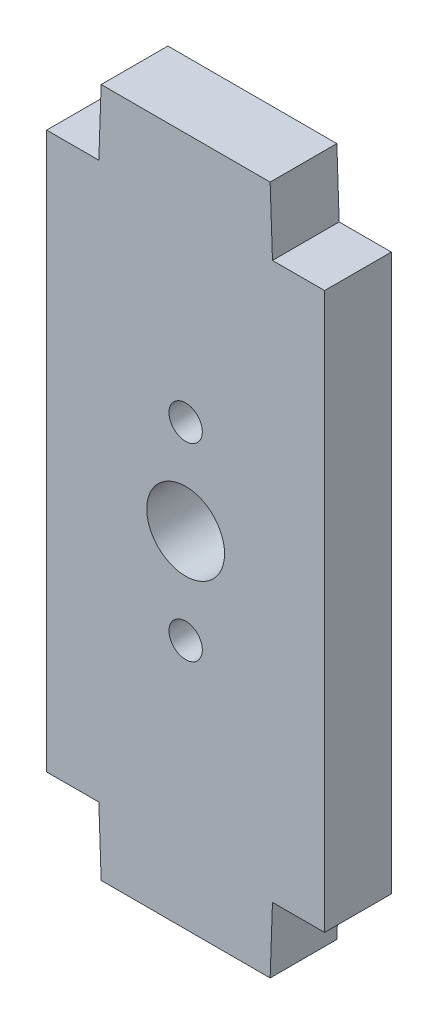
ISO-10303-21;
HEADER;
FILE_DESCRIPTION(('STEP AP214'),'2;1');
FILE_NAME('part.step','',(''),(''),'','','');
FILE_SCHEMA(('AUTOMOTIVE_DESIGN { 1 0 10303 214 1 1 1 1 }'));
ENDSEC;
DATA;
#1=APPLICATION_CONTEXT('core data for automotive mechanical design processes');
#2=APPLICATION_PROTOCOL_DEFINITION('international standard','automotive_design',2000,#1);
#3=PRODUCT_CONTEXT('',#1,'mechanical');
#4=PRODUCT('Part','Part','',(#3));
#5=PRODUCT_RELATED_PRODUCT_CATEGORY('part','',(#4));
#6=PRODUCT_DEFINITION_FORMATION('','',#4);
#7=PRODUCT_DEFINITION_CONTEXT('part definition',#1,'design');
#8=PRODUCT_DEFINITION('design','',#6,#7);
#9=PRODUCT_DEFINITION_SHAPE('','',#8);
#10=(LENGTH_UNIT() NAMED_UNIT(*) SI_UNIT(.MILLI.,.METRE.));
#11=(NAMED_UNIT(*) PLANE_ANGLE_UNIT() SI_UNIT($,.RADIAN.));
#12=(NAMED_UNIT(*) SI_UNIT($,.STERADIAN.) SOLID_ANGLE_UNIT());
#13=UNCERTAINTY_MEASURE_WITH_UNIT(LENGTH_MEASURE(1.E-05),#10,'distance_accuracy_value','');
#14=(GEOMETRIC_REPRESENTATION_CONTEXT(3) GLOBAL_UNCERTAINTY_ASSIGNED_CONTEXT((#13)) GLOBAL_UNIT_ASSIGNED_CONTEXT((#10,
#11,#12)) REPRESENTATION_CONTEXT('',''));
#15=CARTESIAN_POINT('',(0.,0.,0.));
#16=DIRECTION('',(0.,0.,1.));
#17=DIRECTION('',(1.,0.,0.));
#18=AXIS2_PLACEMENT_3D('',#15,#16,#17);
#19=CARTESIAN_POINT('',(-12.5,-25.,6.));
#20=DIRECTION('',(0.,1.,0.));
#21=DIRECTION('',(0.,0.,1.));
#22=AXIS2_PLACEMENT_3D('',#19,#20,#21);
#23=PLANE('',#22);
#24=DIRECTION('',(0.,0.,1.));
#25=VECTOR('',#24,1.);
#26=CARTESIAN_POINT('',(7.8095246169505,-25.,-16.7318468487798));
#27=LINE('',#26,#25);
#28=CARTESIAN_POINT('',(7.8095246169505,-25.,0.));
#29=VERTEX_POINT('',#28);
#30=CARTESIAN_POINT('',(7.8095246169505,-25.,6.));
#31=VERTEX_POINT('',#30);
#32=EDGE_CURVE('E135',#29,#31,#27,.T.);
#33=ORIENTED_EDGE('',*,*,#32,.F.);
#34=DIRECTION('',(1.,0.,0.));
#35=VECTOR('',#34,1.);
#36=CARTESIAN_POINT('',(-12.5,-25.,0.));
#37=LINE('',#36,#35);
#38=CARTESIAN_POINT('',(12.5,-25.,0.));
#39=VERTEX_POINT('',#38);
#40=EDGE_CURVE('E145',#29,#39,#37,.T.);
#41=ORIENTED_EDGE('',*,*,#40,.T.);
#42=DIRECTION('',(0.,0.,-1.));
#43=VECTOR('',#42,1.);
#44=CARTESIAN_POINT('',(12.5,-25.,6.));
#45=LINE('',#44,#43);
#46=CARTESIAN_POINT('',(12.5,-25.,6.));
#47=VERTEX_POINT('',#46);
#48=EDGE_CURVE('E49',#47,#39,#45,.T.);
#49=ORIENTED_EDGE('',*,*,#48,.F.);
#50=DIRECTION('',(1.,0.,0.));
#51=VECTOR('',#50,1.);
#52=CARTESIAN_POINT('',(-12.5,-25.,6.));
#53=LINE('',#52,#51);
#54=EDGE_CURVE('E147',#31,#47,#53,.T.);
#55=ORIENTED_EDGE('',*,*,#54,.F.);
#56=EDGE_LOOP('',(#33,#41,#49,#55));
#57=FACE_BOUND('',#56,.T.);
#58=ADVANCED_FACE('F41',(#57),#23,.F.);
#59=CARTESIAN_POINT('',(-12.5,25.,6.));
#60=DIRECTION('',(0.,-1.,0.));
#61=DIRECTION('',(0.,0.,-1.));
#62=AXIS2_PLACEMENT_3D('',#59,#60,#61);
#63=PLANE('',#62);
#64=DIRECTION('',(0.,0.,1.));
#65=VECTOR('',#64,1.);
#66=CARTESIAN_POINT('',(-7.8095246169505,25.,-16.7318468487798));
#67=LINE('',#66,#65);
#68=CARTESIAN_POINT('',(-7.8095246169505,25.,0.));
#69=VERTEX_POINT('',#68);
#70=CARTESIAN_POINT('',(-7.8095246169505,25.,6.));
#71=VERTEX_POINT('',#70);
#72=EDGE_CURVE('E197',#69,#71,#67,.T.);
#73=ORIENTED_EDGE('',*,*,#72,.F.);
#74=DIRECTION('',(-1.,0.,0.));
#75=VECTOR('',#74,1.);
#76=CARTESIAN_POINT('',(-12.5,25.,0.));
#77=LINE('',#76,#75);
#78=CARTESIAN_POINT('',(-12.5,25.,0.));
#79=VERTEX_POINT('',#78);
#80=EDGE_CURVE('E165',#69,#79,#77,.T.);
#81=ORIENTED_EDGE('',*,*,#80,.T.);
#82=DIRECTION('',(0.,0.,-1.));
#83=VECTOR('',#82,1.);
#84=CARTESIAN_POINT('',(-12.5,25.,6.));
#85=LINE('',#84,#83);
#86=CARTESIAN_POINT('',(-12.5,25.,6.));
#87=VERTEX_POINT('',#86);
#88=EDGE_CURVE('E170',#87,#79,#85,.T.);
#89=ORIENTED_EDGE('',*,*,#88,.F.);
#90=DIRECTION('',(-1.,0.,0.));
#91=VECTOR('',#90,1.);
#92=CARTESIAN_POINT('',(-12.5,25.,6.));
#93=LINE('',#92,#91);
#94=EDGE_CURVE('E184',#71,#87,#93,.T.);
#95=ORIENTED_EDGE('',*,*,#94,.F.);
#96=EDGE_LOOP('',(#73,#81,#89,#95));
#97=FACE_BOUND('',#96,.T.);
#98=ADVANCED_FACE('F264',(#97),#63,.F.);
#99=CARTESIAN_POINT('',(-12.5,-25.,6.));
#100=DIRECTION('',(1.,0.,0.));
#101=DIRECTION('',(0.,0.,-1.));
#102=AXIS2_PLACEMENT_3D('',#99,#100,#101);
#103=PLANE('',#102);
#104=DIRECTION('',(0.,-1.,0.));
#105=VECTOR('',#104,1.);
#106=CARTESIAN_POINT('',(-12.5,-25.,0.));
#107=LINE('',#106,#105);
#108=CARTESIAN_POINT('',(-12.5,-25.,0.));
#109=VERTEX_POINT('',#108);
#110=EDGE_CURVE('E156',#79,#109,#107,.T.);
#111=ORIENTED_EDGE('',*,*,#110,.T.);
#112=DIRECTION('',(0.,0.,-1.));
#113=VECTOR('',#112,1.);
#114=CARTESIAN_POINT('',(-12.5,-25.,6.));
#115=LINE('',#114,#113);
#116=CARTESIAN_POINT('',(-12.5,-25.,6.));
#117=VERTEX_POINT('',#116);
#118=EDGE_CURVE('E11',#117,#109,#115,.T.);
#119=ORIENTED_EDGE('',*,*,#118,.F.);
#120=DIRECTION('',(0.,-1.,0.));
#121=VECTOR('',#120,1.);
#122=CARTESIAN_POINT('',(-12.5,-25.,6.));
#123=LINE('',#122,#121);
#124=EDGE_CURVE('E169',#87,#117,#123,.T.);
#125=ORIENTED_EDGE('',*,*,#124,.F.);
#126=ORIENTED_EDGE('',*,*,#88,.T.);
#127=EDGE_LOOP('',(#111,#119,#125,#126));
#128=FACE_BOUND('',#127,.T.);
#129=ADVANCED_FACE('F43',(#128),#103,.F.);
#130=CARTESIAN_POINT('',(-7.8095246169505,-25.,0.));
#131=VERTEX_POINT('',#130);
#132=EDGE_CURVE('E155',#109,#131,#37,.T.);
#133=ORIENTED_EDGE('',*,*,#132,.T.);
#134=DIRECTION('',(0.,0.,1.));
#135=VECTOR('',#134,1.);
#136=CARTESIAN_POINT('',(-7.8095246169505,-25.,-16.7318468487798));
#137=LINE('',#136,#135);
#138=CARTESIAN_POINT('',(-7.8095246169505,-25.,6.));
#139=VERTEX_POINT('',#138);
#140=EDGE_CURVE('E148',#131,#139,#137,.T.);
#141=ORIENTED_EDGE('',*,*,#140,.T.);
#142=EDGE_CURVE('E185',#117,#139,#53,.T.);
#143=ORIENTED_EDGE('',*,*,#142,.F.);
#144=ORIENTED_EDGE('',*,*,#118,.T.);
#145=EDGE_LOOP('',(#133,#141,#143,#144));
#146=FACE_BOUND('',#145,.T.);
#147=ADVANCED_FACE('F268',(#146),#23,.F.);
#148=CARTESIAN_POINT('',(12.5,-25.,6.));
#149=DIRECTION('',(-1.,0.,0.));
#150=DIRECTION('',(0.,0.,1.));
#151=AXIS2_PLACEMENT_3D('',#148,#149,#150);
#152=PLANE('',#151);
#153=DIRECTION('',(0.,1.,0.));
#154=VECTOR('',#153,1.);
#155=CARTESIAN_POINT('',(12.5,-25.,0.));
#156=LINE('',#155,#154);
#157=CARTESIAN_POINT('',(12.5,25.,0.));
#158=VERTEX_POINT('',#157);
#159=EDGE_CURVE('E154',#39,#158,#156,.T.);
#160=ORIENTED_EDGE('',*,*,#159,.T.);
#161=DIRECTION('',(0.,0.,-1.));
#162=VECTOR('',#161,1.);
#163=CARTESIAN_POINT('',(12.5,25.,6.));
#164=LINE('',#163,#162);
#165=CARTESIAN_POINT('',(12.5,25.,6.));
#166=VERTEX_POINT('',#165);
#167=EDGE_CURVE('E173',#166,#158,#164,.T.);
#168=ORIENTED_EDGE('',*,*,#167,.F.);
#169=DIRECTION('',(0.,1.,0.));
#170=VECTOR('',#169,1.);
#171=CARTESIAN_POINT('',(12.5,-25.,6.));
#172=LINE('',#171,#170);
#173=EDGE_CURVE('E180',#47,#166,#172,.T.);
#174=ORIENTED_EDGE('',*,*,#173,.F.);
#175=ORIENTED_EDGE('',*,*,#48,.T.);
#176=EDGE_LOOP('',(#160,#168,#174,#175));
#177=FACE_BOUND('',#176,.T.);
#178=ADVANCED_FACE('F178',(#177),#152,.F.);
#179=CARTESIAN_POINT('',(7.8095246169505,25.,0.));
#180=VERTEX_POINT('',#179);
#181=EDGE_CURVE('E166',#158,#180,#77,.T.);
#182=ORIENTED_EDGE('',*,*,#181,.T.);
#183=DIRECTION('',(0.,0.,1.));
#184=VECTOR('',#183,1.);
#185=CARTESIAN_POINT('',(7.8095246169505,25.,-16.7318468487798));
#186=LINE('',#185,#184);
#187=CARTESIAN_POINT('',(7.8095246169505,25.,6.));
#188=VERTEX_POINT('',#187);
#189=EDGE_CURVE('E195',#180,#188,#186,.T.);
#190=ORIENTED_EDGE('',*,*,#189,.T.);
#191=EDGE_CURVE('E174',#166,#188,#93,.T.);
#192=ORIENTED_EDGE('',*,*,#191,.F.);
#193=ORIENTED_EDGE('',*,*,#167,.T.);
#194=EDGE_LOOP('',(#182,#190,#192,#193));
#195=FACE_BOUND('',#194,.T.);
#196=ADVANCED_FACE('F194',(#195),#63,.F.);
#197=CARTESIAN_POINT('',(0.,0.,6.));
#198=DIRECTION('',(0.,0.,-1.));
#199=DIRECTION('',(-1.,0.,0.));
#200=AXIS2_PLACEMENT_3D('',#197,#198,#199);
#201=PLANE('',#200);
#202=CARTESIAN_POINT('',(0.,8.5,6.));
#203=DIRECTION('',(0.,0.,1.));
#204=DIRECTION('',(1.,0.,0.));
#205=AXIS2_PLACEMENT_3D('',#202,#203,#204);
#206=CIRCLE('',#205,1.5);
#207=CARTESIAN_POINT('',(1.5,8.5,6.));
#208=VERTEX_POINT('',#207);
#209=EDGE_CURVE('E226',#208,#208,#206,.T.);
#210=ORIENTED_EDGE('',*,*,#209,.F.);
#211=EDGE_LOOP('',(#210));
#212=FACE_BOUND('',#211,.T.);
#213=CARTESIAN_POINT('',(0.,-8.5,6.));
#214=DIRECTION('',(0.,0.,1.));
#215=DIRECTION('',(1.,0.,0.));
#216=AXIS2_PLACEMENT_3D('',#213,#214,#215);
#217=CIRCLE('',#216,1.5);
#218=CARTESIAN_POINT('',(1.5,-8.5,6.));
#219=VERTEX_POINT('',#218);
#220=EDGE_CURVE('E219',#219,#219,#217,.T.);
#221=ORIENTED_EDGE('',*,*,#220,.F.);
#222=EDGE_LOOP('',(#221));
#223=FACE_BOUND('',#222,.T.);
#224=CARTESIAN_POINT('',(0.,0.,6.));
#225=DIRECTION('',(0.,0.,1.));
#226=DIRECTION('',(1.,0.,0.));
#227=AXIS2_PLACEMENT_3D('',#224,#225,#226);
#228=CIRCLE('',#227,3.5);
#229=CARTESIAN_POINT('',(3.5,0.,6.));
#230=VERTEX_POINT('',#229);
#231=EDGE_CURVE('E222',#230,#230,#228,.T.);
#232=ORIENTED_EDGE('',*,*,#231,.F.);
#233=EDGE_LOOP('',(#232));
#234=FACE_BOUND('',#233,.T.);
#235=ORIENTED_EDGE('',*,*,#124,.T.);
#236=ORIENTED_EDGE('',*,*,#142,.T.);
#237=DIRECTION('',(0.0348994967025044,-0.999390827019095,0.));
#238=VECTOR('',#237,1.);
#239=CARTESIAN_POINT('',(-7.8095246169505,-25.,6.));
#240=LINE('',#239,#238);
#241=CARTESIAN_POINT('',(-7.6,-31.,6.));
#242=VERTEX_POINT('',#241);
#243=EDGE_CURVE('E56',#139,#242,#240,.T.);
#244=ORIENTED_EDGE('',*,*,#243,.T.);
#245=DIRECTION('',(1.,0.,0.));
#246=VECTOR('',#245,1.);
#247=CARTESIAN_POINT('',(-7.6,-31.,6.));
#248=LINE('',#247,#246);
#249=CARTESIAN_POINT('',(7.59999999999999,-31.,6.));
#250=VERTEX_POINT('',#249);
#251=EDGE_CURVE('E214',#242,#250,#248,.T.);
#252=ORIENTED_EDGE('',*,*,#251,.T.);
#253=DIRECTION('',(0.0348994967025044,0.999390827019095,0.));
#254=VECTOR('',#253,1.);
#255=CARTESIAN_POINT('',(7.8095246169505,-25.,6.));
#256=LINE('',#255,#254);
#257=EDGE_CURVE('E238',#250,#31,#256,.T.);
#258=ORIENTED_EDGE('',*,*,#257,.T.);
#259=ORIENTED_EDGE('',*,*,#54,.T.);
#260=ORIENTED_EDGE('',*,*,#173,.T.);
#261=ORIENTED_EDGE('',*,*,#191,.T.);
#262=DIRECTION('',(-0.0348994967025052,0.999390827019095,0.));
#263=VECTOR('',#262,1.);
#264=CARTESIAN_POINT('',(7.8095246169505,25.,6.));
#265=LINE('',#264,#263);
#266=CARTESIAN_POINT('',(7.59999999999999,31.,6.));
#267=VERTEX_POINT('',#266);
#268=EDGE_CURVE('E64',#188,#267,#265,.T.);
#269=ORIENTED_EDGE('',*,*,#268,.T.);
#270=DIRECTION('',(-1.,0.,0.));
#271=VECTOR('',#270,1.);
#272=CARTESIAN_POINT('',(7.59999999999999,31.,6.));
#273=LINE('',#272,#271);
#274=CARTESIAN_POINT('',(-7.6,31.,6.));
#275=VERTEX_POINT('',#274);
#276=EDGE_CURVE('E212',#267,#275,#273,.T.);
#277=ORIENTED_EDGE('',*,*,#276,.T.);
#278=DIRECTION('',(-0.0348994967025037,-0.999390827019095,0.));
#279=VECTOR('',#278,1.);
#280=CARTESIAN_POINT('',(-7.8095246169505,25.,6.));
#281=LINE('',#280,#279);
#282=EDGE_CURVE('E215',#275,#71,#281,.T.);
#283=ORIENTED_EDGE('',*,*,#282,.T.);
#284=ORIENTED_EDGE('',*,*,#94,.T.);
#285=EDGE_LOOP('',(#235,#236,#244,#252,#258,#259,#260,#261,#269,#277,#283,#284));
#286=FACE_BOUND('',#285,.T.);
#287=ADVANCED_FACE('F191',(#212,#223,#234,#286),#201,.F.);
#288=CARTESIAN_POINT('',(0.,0.,0.));
#289=DIRECTION('',(0.,0.,-1.));
#290=DIRECTION('',(-1.,0.,0.));
#291=AXIS2_PLACEMENT_3D('',#288,#289,#290);
#292=PLANE('',#291);
#293=CARTESIAN_POINT('',(0.,8.5,0.));
#294=DIRECTION('',(0.,0.,1.));
#295=DIRECTION('',(1.,0.,0.));
#296=AXIS2_PLACEMENT_3D('',#293,#294,#295);
#297=CIRCLE('',#296,1.5);
#298=CARTESIAN_POINT('',(1.5,8.5,0.));
#299=VERTEX_POINT('',#298);
#300=EDGE_CURVE('E229',#299,#299,#297,.T.);
#301=ORIENTED_EDGE('',*,*,#300,.T.);
#302=EDGE_LOOP('',(#301));
#303=FACE_BOUND('',#302,.T.);
#304=CARTESIAN_POINT('',(0.,-8.5,0.));
#305=DIRECTION('',(0.,0.,1.));
#306=DIRECTION('',(1.,0.,0.));
#307=AXIS2_PLACEMENT_3D('',#304,#305,#306);
#308=CIRCLE('',#307,1.5);
#309=CARTESIAN_POINT('',(1.5,-8.5,0.));
#310=VERTEX_POINT('',#309);
#311=EDGE_CURVE('E223',#310,#310,#308,.T.);
#312=ORIENTED_EDGE('',*,*,#311,.T.);
#313=EDGE_LOOP('',(#312));
#314=FACE_BOUND('',#313,.T.);
#315=CARTESIAN_POINT('',(0.,0.,0.));
#316=DIRECTION('',(0.,0.,1.));
#317=DIRECTION('',(1.,0.,0.));
#318=AXIS2_PLACEMENT_3D('',#315,#316,#317);
#319=CIRCLE('',#318,3.5);
#320=CARTESIAN_POINT('',(3.5,0.,0.));
#321=VERTEX_POINT('',#320);
#322=EDGE_CURVE('E160',#321,#321,#319,.T.);
#323=ORIENTED_EDGE('',*,*,#322,.T.);
#324=EDGE_LOOP('',(#323));
#325=FACE_BOUND('',#324,.T.);
#326=ORIENTED_EDGE('',*,*,#110,.F.);
#327=ORIENTED_EDGE('',*,*,#80,.F.);
#328=DIRECTION('',(-0.0348994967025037,-0.999390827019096,0.));
#329=VECTOR('',#328,1.);
#330=CARTESIAN_POINT('',(-7.8095246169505,25.,0.));
#331=LINE('',#330,#329);
#332=CARTESIAN_POINT('',(-7.6,31.,0.));
#333=VERTEX_POINT('',#332);
#334=EDGE_CURVE('E200',#333,#69,#331,.T.);
#335=ORIENTED_EDGE('',*,*,#334,.F.);
#336=DIRECTION('',(-1.,0.,0.));
#337=VECTOR('',#336,1.);
#338=CARTESIAN_POINT('',(7.59999999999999,31.,0.));
#339=LINE('',#338,#337);
#340=CARTESIAN_POINT('',(7.59999999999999,31.,0.));
#341=VERTEX_POINT('',#340);
#342=EDGE_CURVE('E206',#341,#333,#339,.T.);
#343=ORIENTED_EDGE('',*,*,#342,.F.);
#344=DIRECTION('',(-0.0348994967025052,0.999390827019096,0.));
#345=VECTOR('',#344,1.);
#346=CARTESIAN_POINT('',(7.8095246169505,25.,0.));
#347=LINE('',#346,#345);
#348=EDGE_CURVE('E198',#180,#341,#347,.T.);
#349=ORIENTED_EDGE('',*,*,#348,.F.);
#350=ORIENTED_EDGE('',*,*,#181,.F.);
#351=ORIENTED_EDGE('',*,*,#159,.F.);
#352=ORIENTED_EDGE('',*,*,#40,.F.);
#353=DIRECTION('',(0.0348994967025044,0.999390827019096,0.));
#354=VECTOR('',#353,1.);
#355=CARTESIAN_POINT('',(7.8095246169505,-25.,0.));
#356=LINE('',#355,#354);
#357=CARTESIAN_POINT('',(7.59999999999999,-31.,0.));
#358=VERTEX_POINT('',#357);
#359=EDGE_CURVE('E131',#358,#29,#356,.T.);
#360=ORIENTED_EDGE('',*,*,#359,.F.);
#361=DIRECTION('',(1.,0.,0.));
#362=VECTOR('',#361,1.);
#363=CARTESIAN_POINT('',(-7.6,-31.,0.));
#364=LINE('',#363,#362);
#365=CARTESIAN_POINT('',(-7.6,-31.,0.));
#366=VERTEX_POINT('',#365);
#367=EDGE_CURVE('E244',#366,#358,#364,.T.);
#368=ORIENTED_EDGE('',*,*,#367,.F.);
#369=DIRECTION('',(0.0348994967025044,-0.999390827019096,0.));
#370=VECTOR('',#369,1.);
#371=CARTESIAN_POINT('',(-7.8095246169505,-25.,0.));
#372=LINE('',#371,#370);
#373=EDGE_CURVE('E247',#131,#366,#372,.T.);
#374=ORIENTED_EDGE('',*,*,#373,.F.);
#375=ORIENTED_EDGE('',*,*,#132,.F.);
#376=EDGE_LOOP('',(#326,#327,#335,#343,#349,#350,#351,#352,#360,#368,#374,#375));
#377=FACE_BOUND('',#376,.T.);
#378=ADVANCED_FACE('F152',(#303,#314,#325,#377),#292,.T.);
#379=CARTESIAN_POINT('',(0.,0.,0.));
#380=DIRECTION('',(0.,0.,1.));
#381=DIRECTION('',(1.,0.,0.));
#382=AXIS2_PLACEMENT_3D('',#379,#380,#381);
#383=CYLINDRICAL_SURFACE('',#382,3.5);
#384=ORIENTED_EDGE('',*,*,#322,.F.);
#385=EDGE_LOOP('',(#384));
#386=FACE_BOUND('',#385,.T.);
#387=ORIENTED_EDGE('',*,*,#231,.T.);
#388=EDGE_LOOP('',(#387));
#389=FACE_BOUND('',#388,.T.);
#390=ADVANCED_FACE('F304',(#386,#389),#383,.F.);
#391=CARTESIAN_POINT('',(0.,-8.5,0.));
#392=DIRECTION('',(0.,0.,1.));
#393=DIRECTION('',(1.,0.,0.));
#394=AXIS2_PLACEMENT_3D('',#391,#392,#393);
#395=CYLINDRICAL_SURFACE('',#394,1.5);
#396=ORIENTED_EDGE('',*,*,#311,.F.);
#397=EDGE_LOOP('',(#396));
#398=FACE_BOUND('',#397,.T.);
#399=ORIENTED_EDGE('',*,*,#220,.T.);
#400=EDGE_LOOP('',(#399));
#401=FACE_BOUND('',#400,.T.);
#402=ADVANCED_FACE('F308',(#398,#401),#395,.F.);
#403=CARTESIAN_POINT('',(0.,8.5,0.));
#404=DIRECTION('',(0.,0.,1.));
#405=DIRECTION('',(1.,0.,0.));
#406=AXIS2_PLACEMENT_3D('',#403,#404,#405);
#407=CYLINDRICAL_SURFACE('',#406,1.5);
#408=ORIENTED_EDGE('',*,*,#300,.F.);
#409=EDGE_LOOP('',(#408));
#410=FACE_BOUND('',#409,.T.);
#411=ORIENTED_EDGE('',*,*,#209,.T.);
#412=EDGE_LOOP('',(#411));
#413=FACE_BOUND('',#412,.T.);
#414=ADVANCED_FACE('F317',(#410,#413),#407,.F.);
#415=CARTESIAN_POINT('',(-7.8095246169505,25.,-16.7318468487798));
#416=DIRECTION('',(-0.999390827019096,0.0348994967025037,0.));
#417=DIRECTION('',(-0.0348994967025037,-0.999390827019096,0.));
#418=AXIS2_PLACEMENT_3D('',#415,#416,#417);
#419=PLANE('',#418);
#420=DIRECTION('',(0.,0.,1.));
#421=VECTOR('',#420,1.);
#422=CARTESIAN_POINT('',(-7.6,31.,-16.7318468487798));
#423=LINE('',#422,#421);
#424=EDGE_CURVE('E210',#333,#275,#423,.T.);
#425=ORIENTED_EDGE('',*,*,#424,.F.);
#426=ORIENTED_EDGE('',*,*,#334,.T.);
#427=ORIENTED_EDGE('',*,*,#72,.T.);
#428=ORIENTED_EDGE('',*,*,#282,.F.);
#429=EDGE_LOOP('',(#425,#426,#427,#428));
#430=FACE_BOUND('',#429,.T.);
#431=ADVANCED_FACE('F259',(#430),#419,.T.);
#432=CARTESIAN_POINT('',(7.8095246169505,25.,-16.7318468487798));
#433=DIRECTION('',(0.999390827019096,0.0348994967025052,0.));
#434=DIRECTION('',(-0.0348994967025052,0.999390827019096,0.));
#435=AXIS2_PLACEMENT_3D('',#432,#433,#434);
#436=PLANE('',#435);
#437=ORIENTED_EDGE('',*,*,#189,.F.);
#438=ORIENTED_EDGE('',*,*,#348,.T.);
#439=DIRECTION('',(0.,0.,1.));
#440=VECTOR('',#439,1.);
#441=CARTESIAN_POINT('',(7.59999999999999,31.,-16.7318468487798));
#442=LINE('',#441,#440);
#443=EDGE_CURVE('E202',#341,#267,#442,.T.);
#444=ORIENTED_EDGE('',*,*,#443,.T.);
#445=ORIENTED_EDGE('',*,*,#268,.F.);
#446=EDGE_LOOP('',(#437,#438,#444,#445));
#447=FACE_BOUND('',#446,.T.);
#448=ADVANCED_FACE('F374',(#447),#436,.T.);
#449=CARTESIAN_POINT('',(7.59999999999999,31.,-16.7318468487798));
#450=DIRECTION('',(0.,1.,0.));
#451=DIRECTION('',(-1.,0.,0.));
#452=AXIS2_PLACEMENT_3D('',#449,#450,#451);
#453=PLANE('',#452);
#454=ORIENTED_EDGE('',*,*,#443,.F.);
#455=ORIENTED_EDGE('',*,*,#342,.T.);
#456=ORIENTED_EDGE('',*,*,#424,.T.);
#457=ORIENTED_EDGE('',*,*,#276,.F.);
#458=EDGE_LOOP('',(#454,#455,#456,#457));
#459=FACE_BOUND('',#458,.T.);
#460=ADVANCED_FACE('F257',(#459),#453,.T.);
#461=CARTESIAN_POINT('',(7.8095246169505,-25.,-16.7318468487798));
#462=DIRECTION('',(0.999390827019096,-0.0348994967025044,0.));
#463=DIRECTION('',(0.0348994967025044,0.999390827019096,0.));
#464=AXIS2_PLACEMENT_3D('',#461,#462,#463);
#465=PLANE('',#464);
#466=DIRECTION('',(0.,0.,1.));
#467=VECTOR('',#466,1.);
#468=CARTESIAN_POINT('',(7.59999999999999,-31.,-16.7318468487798));
#469=LINE('',#468,#467);
#470=EDGE_CURVE('E137',#358,#250,#469,.T.);
#471=ORIENTED_EDGE('',*,*,#470,.F.);
#472=ORIENTED_EDGE('',*,*,#359,.T.);
#473=ORIENTED_EDGE('',*,*,#32,.T.);
#474=ORIENTED_EDGE('',*,*,#257,.F.);
#475=EDGE_LOOP('',(#471,#472,#473,#474));
#476=FACE_BOUND('',#475,.T.);
#477=ADVANCED_FACE('F133',(#476),#465,.T.);
#478=CARTESIAN_POINT('',(-7.8095246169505,-25.,-16.7318468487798));
#479=DIRECTION('',(-0.999390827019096,-0.0348994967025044,0.));
#480=DIRECTION('',(0.0348994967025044,-0.999390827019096,0.));
#481=AXIS2_PLACEMENT_3D('',#478,#479,#480);
#482=PLANE('',#481);
#483=ORIENTED_EDGE('',*,*,#140,.F.);
#484=ORIENTED_EDGE('',*,*,#373,.T.);
#485=DIRECTION('',(0.,0.,1.));
#486=VECTOR('',#485,1.);
#487=CARTESIAN_POINT('',(-7.6,-31.,-16.7318468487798));
#488=LINE('',#487,#486);
#489=EDGE_CURVE('E246',#366,#242,#488,.T.);
#490=ORIENTED_EDGE('',*,*,#489,.T.);
#491=ORIENTED_EDGE('',*,*,#243,.F.);
#492=EDGE_LOOP('',(#483,#484,#490,#491));
#493=FACE_BOUND('',#492,.T.);
#494=ADVANCED_FACE('F269',(#493),#482,.T.);
#495=CARTESIAN_POINT('',(-7.6,-31.,-16.7318468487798));
#496=DIRECTION('',(0.,-1.,0.));
#497=DIRECTION('',(0.,0.,-1.));
#498=AXIS2_PLACEMENT_3D('',#495,#496,#497);
#499=PLANE('',#498);
#500=ORIENTED_EDGE('',*,*,#489,.F.);
#501=ORIENTED_EDGE('',*,*,#367,.T.);
#502=ORIENTED_EDGE('',*,*,#470,.T.);
#503=ORIENTED_EDGE('',*,*,#251,.F.);
#504=EDGE_LOOP('',(#500,#501,#502,#503));
#505=FACE_BOUND('',#504,.T.);
#506=ADVANCED_FACE('F272',(#505),#499,.T.);
#507=CLOSED_SHELL('',(#58,#98,#129,#147,#178,#196,#287,#378,#390,#402,#414,#431,#448,#460,#477,
#494,#506));
#508=MANIFOLD_SOLID_BREP('B2',#507);
#509=ADVANCED_BREP_SHAPE_REPRESENTATION('',(#18,#508),#14);
#510=SHAPE_DEFINITION_REPRESENTATION(#9,#509);
ENDSEC;
END-ISO-10303-21;
